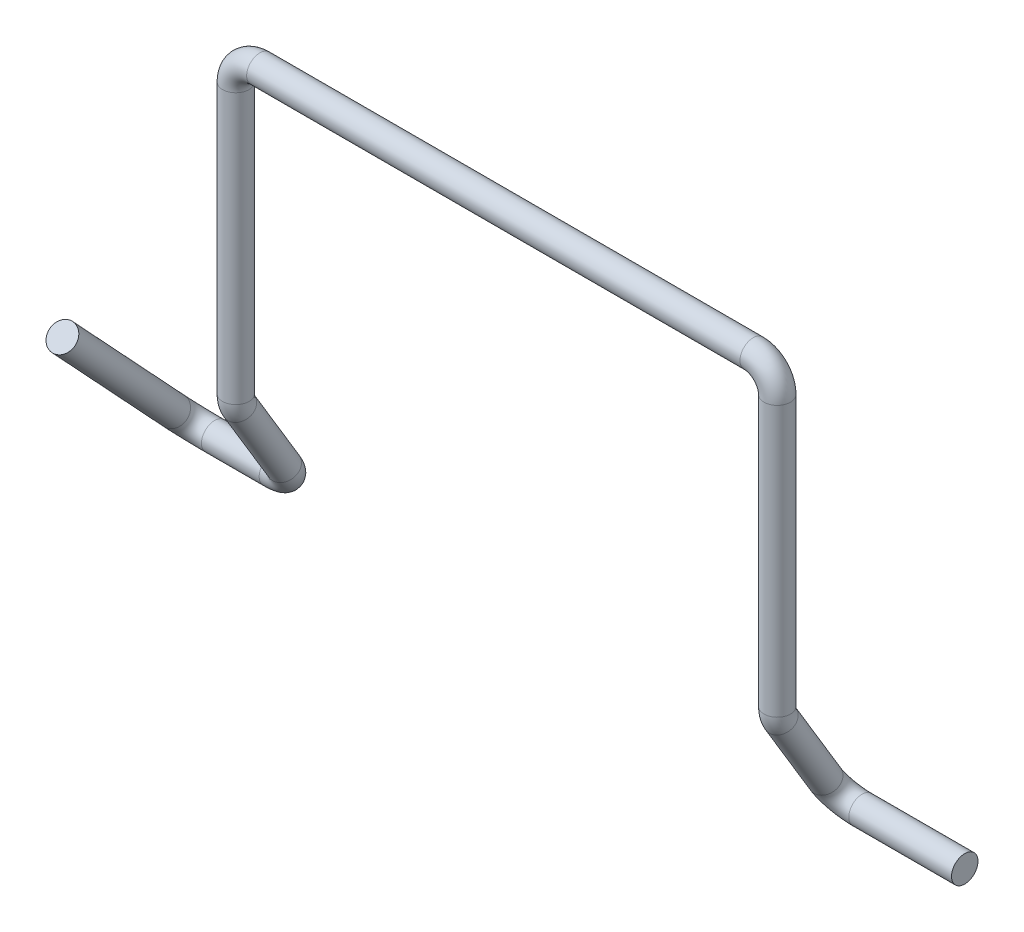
from build123d import *

# Parameters (mm, degrees)
SKETCH6_R = 0.6985


with BuildPart() as part:
    # Sweep1: sweep along a curve in space
    with BuildLine() as sweep1_path:
        Line((-34.163, -13.94222204, 3.564137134), (-34.163, -20.267480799, -2.334262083))
        ThreePointArc((-34.163, -20.267480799, -2.334262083), (-33.791025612, -20.924255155, -2.946714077), (-32.893, -21.1963, -3.2004))
        Line((-32.893, -21.1963, -3.2004), (-29.845, -21.1963, -3.2004))
        ThreePointArc((-29.845, -21.1963, -3.2004), (-28.946974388, -20.877536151, -3.008685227), (-28.575, -20.107972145, -2.545844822))
        Line((-28.575, -20.107972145, -2.545844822), (-28.575, -16.177065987, -0.181672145))
        ThreePointArc((-28.575, -16.177065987, -0.181672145), (-28.575, -15.862160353, -0.046260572), (-28.575, -15.52251081, 0))
        Line((-28.575, -15.52251081, 0), (-28.575, -1.27, 0))
        ThreePointArc((-28.575, -1.27, 0), (-28.203025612, -0.371974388, 0), (-27.305, 0, 0))
        Line((-27.305, 0, 0), (-1.27, 0, 0))
        ThreePointArc((-1.27, 0, 0), (-0.371974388, -0.371974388, 0), (0, -1.27, 0))
        Line((0, -1.27, 0), (0, -15.52251081, 0))
        ThreePointArc((0, -15.52251081, 0), (0, -15.862160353, -0.046260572), (0, -16.177065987, -0.181672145))
        Line((0, -16.177065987, -0.181672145), (0, -20.107972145, -2.545844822))
        ThreePointArc((0, -20.107972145, -2.545844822), (0.371974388, -20.877536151, -3.008685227), (1.27, -21.1963, -3.2004))
        Line((1.27, -21.1963, -3.2004), (6.6929, -21.1963, -3.2004))
    # Sketch6 → Sweep1 (sweep)
    with BuildSketch(Plane(origin=(6.6929, -21.1963, -3.2004), x_dir=(0, 0, -1), z_dir=(1, 0, 0))):
        Circle(SKETCH6_R)
    sweep(path=sweep1_path.line)


solid = part.part
